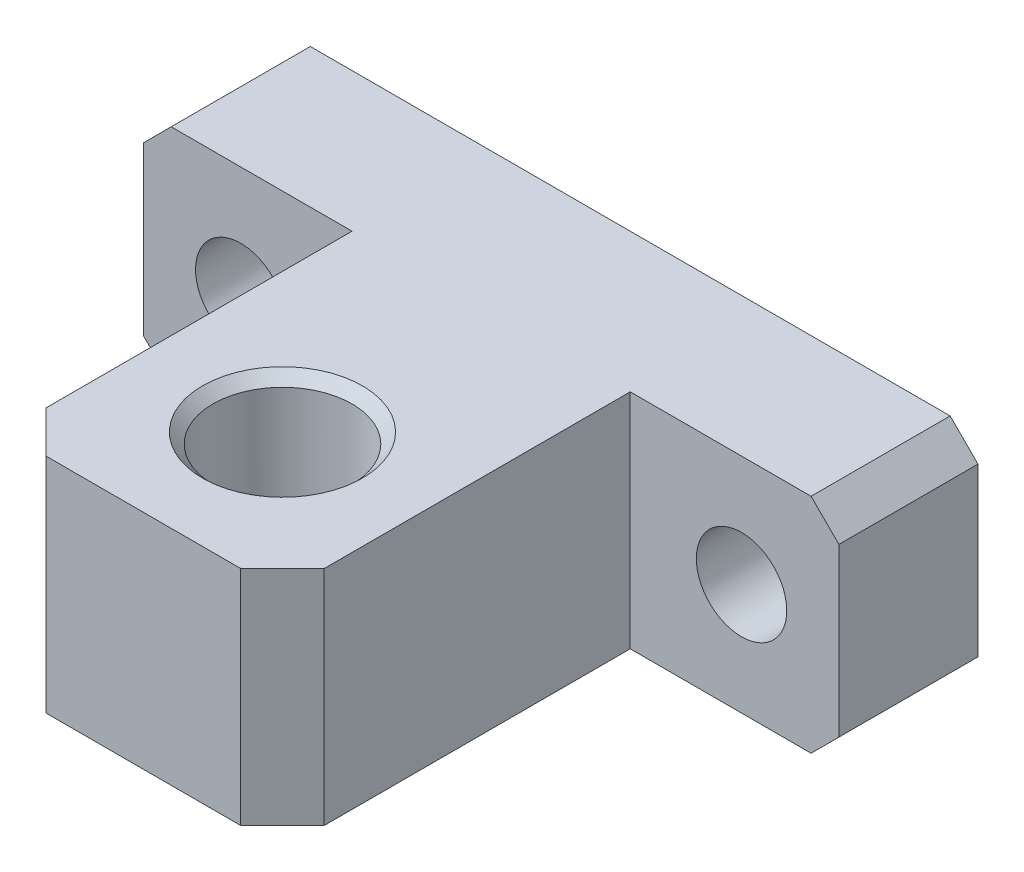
ISO-10303-21;
HEADER;
FILE_DESCRIPTION(('STEP AP214'),'2;1');
FILE_NAME('part.step','',(''),(''),'','','');
FILE_SCHEMA(('AUTOMOTIVE_DESIGN { 1 0 10303 214 1 1 1 1 }'));
ENDSEC;
DATA;
#1=APPLICATION_CONTEXT('core data for automotive mechanical design processes');
#2=APPLICATION_PROTOCOL_DEFINITION('international standard','automotive_design',2000,#1);
#3=PRODUCT_CONTEXT('',#1,'mechanical');
#4=PRODUCT('Part','Part','',(#3));
#5=PRODUCT_RELATED_PRODUCT_CATEGORY('part','',(#4));
#6=PRODUCT_DEFINITION_FORMATION('','',#4);
#7=PRODUCT_DEFINITION_CONTEXT('part definition',#1,'design');
#8=PRODUCT_DEFINITION('design','',#6,#7);
#9=PRODUCT_DEFINITION_SHAPE('','',#8);
#10=(LENGTH_UNIT() NAMED_UNIT(*) SI_UNIT(.MILLI.,.METRE.));
#11=(NAMED_UNIT(*) PLANE_ANGLE_UNIT() SI_UNIT($,.RADIAN.));
#12=(NAMED_UNIT(*) SI_UNIT($,.STERADIAN.) SOLID_ANGLE_UNIT());
#13=UNCERTAINTY_MEASURE_WITH_UNIT(LENGTH_MEASURE(1.E-05),#10,'distance_accuracy_value','');
#14=(GEOMETRIC_REPRESENTATION_CONTEXT(3) GLOBAL_UNCERTAINTY_ASSIGNED_CONTEXT((#13)) GLOBAL_UNIT_ASSIGNED_CONTEXT((#10,
#11,#12)) REPRESENTATION_CONTEXT('',''));
#15=CARTESIAN_POINT('',(0.,0.,0.));
#16=DIRECTION('',(0.,0.,1.));
#17=DIRECTION('',(1.,0.,0.));
#18=AXIS2_PLACEMENT_3D('',#15,#16,#17);
#19=CARTESIAN_POINT('',(-7.,8.,10.));
#20=DIRECTION('',(-1.,0.,0.));
#21=DIRECTION('',(0.,0.,-1.));
#22=AXIS2_PLACEMENT_3D('',#19,#20,#21);
#23=PLANE('',#22);
#24=DIRECTION('',(0.,-1.,0.));
#25=VECTOR('',#24,1.);
#26=CARTESIAN_POINT('',(-7.,8.,0.));
#27=LINE('',#26,#25);
#28=CARTESIAN_POINT('',(-7.,6.,0.));
#29=VERTEX_POINT('',#28);
#30=CARTESIAN_POINT('',(-7.,-6.,0.));
#31=VERTEX_POINT('',#30);
#32=EDGE_CURVE('E152',#29,#31,#27,.T.);
#33=ORIENTED_EDGE('',*,*,#32,.T.);
#34=DIRECTION('',(0.,0.,1.));
#35=VECTOR('',#34,1.);
#36=CARTESIAN_POINT('',(-7.,-6.,10.));
#37=LINE('',#36,#35);
#38=CARTESIAN_POINT('',(-7.,-6.,10.));
#39=VERTEX_POINT('',#38);
#40=EDGE_CURVE('E209',#31,#39,#37,.T.);
#41=ORIENTED_EDGE('',*,*,#40,.T.);
#42=DIRECTION('',(0.,-1.,0.));
#43=VECTOR('',#42,1.);
#44=CARTESIAN_POINT('',(-7.,8.,10.));
#45=LINE('',#44,#43);
#46=CARTESIAN_POINT('',(-7.,6.,10.));
#47=VERTEX_POINT('',#46);
#48=EDGE_CURVE('E168',#47,#39,#45,.T.);
#49=ORIENTED_EDGE('',*,*,#48,.F.);
#50=DIRECTION('',(0.,0.,-1.));
#51=VECTOR('',#50,1.);
#52=CARTESIAN_POINT('',(-7.,6.,10.));
#53=LINE('',#52,#51);
#54=EDGE_CURVE('E206',#47,#29,#53,.T.);
#55=ORIENTED_EDGE('',*,*,#54,.T.);
#56=EDGE_LOOP('',(#33,#41,#49,#55));
#57=FACE_BOUND('',#56,.T.);
#58=ADVANCED_FACE('F14',(#57),#23,.T.);
#59=CARTESIAN_POINT('',(8.,8.,10.));
#60=DIRECTION('',(0.,0.,1.));
#61=DIRECTION('',(-1.,0.,0.));
#62=AXIS2_PLACEMENT_3D('',#59,#60,#61);
#63=PLANE('',#62);
#64=CARTESIAN_POINT('',(0.,0.,10.));
#65=DIRECTION('',(0.,0.,1.));
#66=DIRECTION('',(0.,-1.,0.));
#67=AXIS2_PLACEMENT_3D('',#64,#65,#66);
#68=CIRCLE('',#67,3.25);
#69=CARTESIAN_POINT('',(0.,-3.25,10.));
#70=VERTEX_POINT('',#69);
#71=EDGE_CURVE('E317',#70,#70,#68,.T.);
#72=ORIENTED_EDGE('',*,*,#71,.F.);
#73=EDGE_LOOP('',(#72));
#74=FACE_BOUND('',#73,.T.);
#75=ORIENTED_EDGE('',*,*,#48,.T.);
#76=DIRECTION('',(0.707106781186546,-0.707106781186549,0.));
#77=VECTOR('',#76,1.);
#78=CARTESIAN_POINT('',(-6.5,-6.5,10.));
#79=LINE('',#78,#77);
#80=CARTESIAN_POINT('',(-5.,-8.,10.));
#81=VERTEX_POINT('',#80);
#82=EDGE_CURVE('E213',#39,#81,#79,.T.);
#83=ORIENTED_EDGE('',*,*,#82,.T.);
#84=DIRECTION('',(-1.,0.,0.));
#85=VECTOR('',#84,1.);
#86=CARTESIAN_POINT('',(8.,-8.,10.));
#87=LINE('',#86,#85);
#88=CARTESIAN_POINT('',(8.,-8.,10.));
#89=VERTEX_POINT('',#88);
#90=EDGE_CURVE('E165',#89,#81,#87,.T.);
#91=ORIENTED_EDGE('',*,*,#90,.F.);
#92=DIRECTION('',(0.,-1.,0.));
#93=VECTOR('',#92,1.);
#94=CARTESIAN_POINT('',(8.,8.,10.));
#95=LINE('',#94,#93);
#96=CARTESIAN_POINT('',(8.,8.,10.));
#97=VERTEX_POINT('',#96);
#98=EDGE_CURVE('E137',#97,#89,#95,.T.);
#99=ORIENTED_EDGE('',*,*,#98,.F.);
#100=DIRECTION('',(-1.,0.,0.));
#101=VECTOR('',#100,1.);
#102=CARTESIAN_POINT('',(8.,8.,10.));
#103=LINE('',#102,#101);
#104=CARTESIAN_POINT('',(-5.,8.,10.));
#105=VERTEX_POINT('',#104);
#106=EDGE_CURVE('E149',#97,#105,#103,.T.);
#107=ORIENTED_EDGE('',*,*,#106,.T.);
#108=DIRECTION('',(0.707106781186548,0.707106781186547,0.));
#109=VECTOR('',#108,1.);
#110=CARTESIAN_POINT('',(1.5,14.5,10.));
#111=LINE('',#110,#109);
#112=EDGE_CURVE('E211',#105,#47,#111,.F.);
#113=ORIENTED_EDGE('',*,*,#112,.T.);
#114=EDGE_LOOP('',(#75,#83,#91,#99,#107,#113));
#115=FACE_BOUND('',#114,.T.);
#116=ADVANCED_FACE('F250',(#74,#115),#63,.T.);
#117=CARTESIAN_POINT('',(8.,8.,35.));
#118=DIRECTION('',(-1.,0.,0.));
#119=DIRECTION('',(0.,0.,-1.));
#120=AXIS2_PLACEMENT_3D('',#117,#118,#119);
#121=PLANE('',#120);
#122=DIRECTION('',(0.,0.,-1.));
#123=VECTOR('',#122,1.);
#124=CARTESIAN_POINT('',(8.,-8.,35.));
#125=LINE('',#124,#123);
#126=CARTESIAN_POINT('',(8.,-8.,32.));
#127=VERTEX_POINT('',#126);
#128=EDGE_CURVE('E163',#127,#89,#125,.T.);
#129=ORIENTED_EDGE('',*,*,#128,.F.);
#130=DIRECTION('',(0.,1.,0.));
#131=VECTOR('',#130,1.);
#132=CARTESIAN_POINT('',(8.,8.,32.));
#133=LINE('',#132,#131);
#134=CARTESIAN_POINT('',(8.,8.,32.));
#135=VERTEX_POINT('',#134);
#136=EDGE_CURVE('E38',#127,#135,#133,.T.);
#137=ORIENTED_EDGE('',*,*,#136,.T.);
#138=DIRECTION('',(0.,0.,-1.));
#139=VECTOR('',#138,1.);
#140=CARTESIAN_POINT('',(8.,8.,35.));
#141=LINE('',#140,#139);
#142=EDGE_CURVE('E144',#135,#97,#141,.T.);
#143=ORIENTED_EDGE('',*,*,#142,.T.);
#144=ORIENTED_EDGE('',*,*,#98,.T.);
#145=EDGE_LOOP('',(#129,#137,#143,#144));
#146=FACE_BOUND('',#145,.T.);
#147=ADVANCED_FACE('F256',(#146),#121,.T.);
#148=CARTESIAN_POINT('',(28.,8.,35.));
#149=DIRECTION('',(0.,0.,1.));
#150=DIRECTION('',(0.,-1.,0.));
#151=AXIS2_PLACEMENT_3D('',#148,#149,#150);
#152=PLANE('',#151);
#153=DIRECTION('',(-1.,0.,0.));
#154=VECTOR('',#153,1.);
#155=CARTESIAN_POINT('',(28.,8.,35.));
#156=LINE('',#155,#154);
#157=CARTESIAN_POINT('',(25.,8.,35.));
#158=VERTEX_POINT('',#157);
#159=CARTESIAN_POINT('',(11.,8.,35.));
#160=VERTEX_POINT('',#159);
#161=EDGE_CURVE('E141',#158,#160,#156,.T.);
#162=ORIENTED_EDGE('',*,*,#161,.T.);
#163=DIRECTION('',(0.,-1.,0.));
#164=VECTOR('',#163,1.);
#165=CARTESIAN_POINT('',(11.,8.,35.));
#166=LINE('',#165,#164);
#167=CARTESIAN_POINT('',(11.,-8.,35.));
#168=VERTEX_POINT('',#167);
#169=EDGE_CURVE('E217',#160,#168,#166,.T.);
#170=ORIENTED_EDGE('',*,*,#169,.T.);
#171=DIRECTION('',(-1.,0.,0.));
#172=VECTOR('',#171,1.);
#173=CARTESIAN_POINT('',(28.,-8.,35.));
#174=LINE('',#173,#172);
#175=CARTESIAN_POINT('',(25.,-8.,35.));
#176=VERTEX_POINT('',#175);
#177=EDGE_CURVE('E160',#176,#168,#174,.T.);
#178=ORIENTED_EDGE('',*,*,#177,.F.);
#179=DIRECTION('',(0.,1.,0.));
#180=VECTOR('',#179,1.);
#181=CARTESIAN_POINT('',(25.,8.,35.));
#182=LINE('',#181,#180);
#183=EDGE_CURVE('E215',#176,#158,#182,.T.);
#184=ORIENTED_EDGE('',*,*,#183,.T.);
#185=EDGE_LOOP('',(#162,#170,#178,#184));
#186=FACE_BOUND('',#185,.T.);
#187=ADVANCED_FACE('F288',(#186),#152,.T.);
#188=CARTESIAN_POINT('',(28.,8.,10.));
#189=DIRECTION('',(1.,0.,0.));
#190=DIRECTION('',(0.,0.,1.));
#191=AXIS2_PLACEMENT_3D('',#188,#189,#190);
#192=PLANE('',#191);
#193=DIRECTION('',(0.,0.,1.));
#194=VECTOR('',#193,1.);
#195=CARTESIAN_POINT('',(28.,8.,10.));
#196=LINE('',#195,#194);
#197=CARTESIAN_POINT('',(28.,8.,10.));
#198=VERTEX_POINT('',#197);
#199=CARTESIAN_POINT('',(28.,8.,32.));
#200=VERTEX_POINT('',#199);
#201=EDGE_CURVE('E128',#198,#200,#196,.T.);
#202=ORIENTED_EDGE('',*,*,#201,.T.);
#203=DIRECTION('',(0.,-1.,0.));
#204=VECTOR('',#203,1.);
#205=CARTESIAN_POINT('',(28.,8.,32.));
#206=LINE('',#205,#204);
#207=CARTESIAN_POINT('',(28.,-8.,32.));
#208=VERTEX_POINT('',#207);
#209=EDGE_CURVE('E228',#200,#208,#206,.T.);
#210=ORIENTED_EDGE('',*,*,#209,.T.);
#211=DIRECTION('',(0.,0.,1.));
#212=VECTOR('',#211,1.);
#213=CARTESIAN_POINT('',(28.,-8.,10.));
#214=LINE('',#213,#212);
#215=CARTESIAN_POINT('',(28.,-8.,10.));
#216=VERTEX_POINT('',#215);
#217=EDGE_CURVE('E136',#216,#208,#214,.T.);
#218=ORIENTED_EDGE('',*,*,#217,.F.);
#219=DIRECTION('',(0.,-1.,0.));
#220=VECTOR('',#219,1.);
#221=CARTESIAN_POINT('',(28.,8.,10.));
#222=LINE('',#221,#220);
#223=EDGE_CURVE('E123',#198,#216,#222,.T.);
#224=ORIENTED_EDGE('',*,*,#223,.F.);
#225=EDGE_LOOP('',(#202,#210,#218,#224));
#226=FACE_BOUND('',#225,.T.);
#227=ADVANCED_FACE('F132',(#226),#192,.T.);
#228=CARTESIAN_POINT('',(43.,8.,10.));
#229=DIRECTION('',(0.,0.,1.));
#230=DIRECTION('',(-1.,0.,0.));
#231=AXIS2_PLACEMENT_3D('',#228,#229,#230);
#232=PLANE('',#231);
#233=CARTESIAN_POINT('',(36.,0.,10.));
#234=DIRECTION('',(0.,0.,1.));
#235=DIRECTION('',(0.,-1.,0.));
#236=AXIS2_PLACEMENT_3D('',#233,#234,#235);
#237=CIRCLE('',#236,3.25);
#238=CARTESIAN_POINT('',(36.,-3.24999999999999,10.));
#239=VERTEX_POINT('',#238);
#240=EDGE_CURVE('E323',#239,#239,#237,.T.);
#241=ORIENTED_EDGE('',*,*,#240,.F.);
#242=EDGE_LOOP('',(#241));
#243=FACE_BOUND('',#242,.T.);
#244=DIRECTION('',(-1.,0.,0.));
#245=VECTOR('',#244,1.);
#246=CARTESIAN_POINT('',(43.,-8.,10.));
#247=LINE('',#246,#245);
#248=CARTESIAN_POINT('',(41.,-8.,10.));
#249=VERTEX_POINT('',#248);
#250=EDGE_CURVE('E156',#249,#216,#247,.T.);
#251=ORIENTED_EDGE('',*,*,#250,.F.);
#252=DIRECTION('',(0.707106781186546,0.707106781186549,0.));
#253=VECTOR('',#252,1.);
#254=CARTESIAN_POINT('',(50.,1.00000000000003,10.));
#255=LINE('',#254,#253);
#256=CARTESIAN_POINT('',(43.,-6.,10.));
#257=VERTEX_POINT('',#256);
#258=EDGE_CURVE('E187',#249,#257,#255,.T.);
#259=ORIENTED_EDGE('',*,*,#258,.T.);
#260=DIRECTION('',(0.,-1.,0.));
#261=VECTOR('',#260,1.);
#262=CARTESIAN_POINT('',(43.,8.,10.));
#263=LINE('',#262,#261);
#264=CARTESIAN_POINT('',(43.,6.,10.));
#265=VERTEX_POINT('',#264);
#266=EDGE_CURVE('E138',#265,#257,#263,.T.);
#267=ORIENTED_EDGE('',*,*,#266,.F.);
#268=DIRECTION('',(0.707106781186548,-0.707106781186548,0.));
#269=VECTOR('',#268,1.);
#270=CARTESIAN_POINT('',(42.,7.,10.));
#271=LINE('',#270,#269);
#272=CARTESIAN_POINT('',(41.,8.,10.));
#273=VERTEX_POINT('',#272);
#274=EDGE_CURVE('E126',#265,#273,#271,.F.);
#275=ORIENTED_EDGE('',*,*,#274,.T.);
#276=DIRECTION('',(-1.,0.,0.));
#277=VECTOR('',#276,1.);
#278=CARTESIAN_POINT('',(43.,8.,10.));
#279=LINE('',#278,#277);
#280=EDGE_CURVE('E119',#273,#198,#279,.T.);
#281=ORIENTED_EDGE('',*,*,#280,.T.);
#282=ORIENTED_EDGE('',*,*,#223,.T.);
#283=EDGE_LOOP('',(#251,#259,#267,#275,#281,#282));
#284=FACE_BOUND('',#283,.T.);
#285=ADVANCED_FACE('F122',(#243,#284),#232,.T.);
#286=CARTESIAN_POINT('',(43.,8.,0.));
#287=DIRECTION('',(1.,0.,0.));
#288=DIRECTION('',(0.,0.,1.));
#289=AXIS2_PLACEMENT_3D('',#286,#287,#288);
#290=PLANE('',#289);
#291=ORIENTED_EDGE('',*,*,#266,.T.);
#292=DIRECTION('',(0.,0.,-1.));
#293=VECTOR('',#292,1.);
#294=CARTESIAN_POINT('',(43.,-6.,0.));
#295=LINE('',#294,#293);
#296=CARTESIAN_POINT('',(43.,-6.,0.));
#297=VERTEX_POINT('',#296);
#298=EDGE_CURVE('E192',#257,#297,#295,.T.);
#299=ORIENTED_EDGE('',*,*,#298,.T.);
#300=DIRECTION('',(0.,-1.,0.));
#301=VECTOR('',#300,1.);
#302=CARTESIAN_POINT('',(43.,8.,0.));
#303=LINE('',#302,#301);
#304=CARTESIAN_POINT('',(43.,6.,0.));
#305=VERTEX_POINT('',#304);
#306=EDGE_CURVE('E176',#305,#297,#303,.T.);
#307=ORIENTED_EDGE('',*,*,#306,.F.);
#308=DIRECTION('',(0.,0.,1.));
#309=VECTOR('',#308,1.);
#310=CARTESIAN_POINT('',(43.,6.,0.));
#311=LINE('',#310,#309);
#312=EDGE_CURVE('E189',#305,#265,#311,.T.);
#313=ORIENTED_EDGE('',*,*,#312,.T.);
#314=EDGE_LOOP('',(#291,#299,#307,#313));
#315=FACE_BOUND('',#314,.T.);
#316=ADVANCED_FACE('F296',(#315),#290,.T.);
#317=CARTESIAN_POINT('',(-7.,8.,0.));
#318=DIRECTION('',(0.,0.,-1.));
#319=DIRECTION('',(0.,1.,0.));
#320=AXIS2_PLACEMENT_3D('',#317,#318,#319);
#321=PLANE('',#320);
#322=CARTESIAN_POINT('',(36.,0.,0.));
#323=DIRECTION('',(0.,0.,-1.));
#324=DIRECTION('',(0.,1.,0.));
#325=AXIS2_PLACEMENT_3D('',#322,#323,#324);
#326=CIRCLE('',#325,3.25);
#327=CARTESIAN_POINT('',(36.,3.25,0.));
#328=VERTEX_POINT('',#327);
#329=EDGE_CURVE('E320',#328,#328,#326,.T.);
#330=ORIENTED_EDGE('',*,*,#329,.F.);
#331=EDGE_LOOP('',(#330));
#332=FACE_BOUND('',#331,.T.);
#333=CARTESIAN_POINT('',(0.,0.,0.));
#334=DIRECTION('',(0.,0.,-1.));
#335=DIRECTION('',(0.,1.,0.));
#336=AXIS2_PLACEMENT_3D('',#333,#334,#335);
#337=CIRCLE('',#336,3.25);
#338=CARTESIAN_POINT('',(0.,3.25,0.));
#339=VERTEX_POINT('',#338);
#340=EDGE_CURVE('E157',#339,#339,#337,.T.);
#341=ORIENTED_EDGE('',*,*,#340,.F.);
#342=EDGE_LOOP('',(#341));
#343=FACE_BOUND('',#342,.T.);
#344=ORIENTED_EDGE('',*,*,#306,.T.);
#345=DIRECTION('',(-0.707106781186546,-0.707106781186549,0.));
#346=VECTOR('',#345,1.);
#347=CARTESIAN_POINT('',(25.,-24.,0.));
#348=LINE('',#347,#346);
#349=CARTESIAN_POINT('',(41.,-8.,0.));
#350=VERTEX_POINT('',#349);
#351=EDGE_CURVE('E200',#297,#350,#348,.T.);
#352=ORIENTED_EDGE('',*,*,#351,.T.);
#353=DIRECTION('',(1.,0.,0.));
#354=VECTOR('',#353,1.);
#355=CARTESIAN_POINT('',(-7.,-8.,0.));
#356=LINE('',#355,#354);
#357=CARTESIAN_POINT('',(-5.,-8.,0.));
#358=VERTEX_POINT('',#357);
#359=EDGE_CURVE('E153',#358,#350,#356,.T.);
#360=ORIENTED_EDGE('',*,*,#359,.F.);
#361=DIRECTION('',(-0.707106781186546,0.707106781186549,0.));
#362=VECTOR('',#361,1.);
#363=CARTESIAN_POINT('',(-14.,1.00000000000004,0.));
#364=LINE('',#363,#362);
#365=EDGE_CURVE('E196',#358,#31,#364,.T.);
#366=ORIENTED_EDGE('',*,*,#365,.T.);
#367=ORIENTED_EDGE('',*,*,#32,.F.);
#368=DIRECTION('',(-0.707106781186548,-0.707106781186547,0.));
#369=VECTOR('',#368,1.);
#370=CARTESIAN_POINT('',(-6.,7.,0.));
#371=LINE('',#370,#369);
#372=CARTESIAN_POINT('',(-5.,8.,0.));
#373=VERTEX_POINT('',#372);
#374=EDGE_CURVE('E194',#29,#373,#371,.F.);
#375=ORIENTED_EDGE('',*,*,#374,.T.);
#376=DIRECTION('',(1.,0.,0.));
#377=VECTOR('',#376,1.);
#378=CARTESIAN_POINT('',(-7.,8.,0.));
#379=LINE('',#378,#377);
#380=CARTESIAN_POINT('',(41.,8.,0.));
#381=VERTEX_POINT('',#380);
#382=EDGE_CURVE('E129',#373,#381,#379,.T.);
#383=ORIENTED_EDGE('',*,*,#382,.T.);
#384=DIRECTION('',(-0.707106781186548,0.707106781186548,0.));
#385=VECTOR('',#384,1.);
#386=CARTESIAN_POINT('',(17.,32.,0.));
#387=LINE('',#386,#385);
#388=EDGE_CURVE('E198',#381,#305,#387,.F.);
#389=ORIENTED_EDGE('',*,*,#388,.T.);
#390=EDGE_LOOP('',(#344,#352,#360,#366,#367,#375,#383,#389));
#391=FACE_BOUND('',#390,.T.);
#392=ADVANCED_FACE('F261',(#332,#343,#391),#321,.T.);
#393=CARTESIAN_POINT('',(-7.,8.,10.));
#394=DIRECTION('',(0.,1.,0.));
#395=DIRECTION('',(-1.,0.,0.));
#396=AXIS2_PLACEMENT_3D('',#393,#394,#395);
#397=PLANE('',#396);
#398=CARTESIAN_POINT('',(18.,8.,25.));
#399=DIRECTION('',(0.,1.,0.));
#400=DIRECTION('',(-1.,0.,0.));
#401=AXIS2_PLACEMENT_3D('',#398,#399,#400);
#402=CIRCLE('',#401,5.75);
#403=CARTESIAN_POINT('',(12.25,8.,25.));
#404=VERTEX_POINT('',#403);
#405=EDGE_CURVE('E23',#404,#404,#402,.F.);
#406=ORIENTED_EDGE('',*,*,#405,.T.);
#407=EDGE_LOOP('',(#406));
#408=FACE_BOUND('',#407,.T.);
#409=ORIENTED_EDGE('',*,*,#142,.F.);
#410=DIRECTION('',(-0.707106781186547,0.,-0.707106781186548));
#411=VECTOR('',#410,1.);
#412=CARTESIAN_POINT('',(-10.5,8.,13.5));
#413=LINE('',#412,#411);
#414=EDGE_CURVE('E226',#135,#160,#413,.F.);
#415=ORIENTED_EDGE('',*,*,#414,.T.);
#416=ORIENTED_EDGE('',*,*,#161,.F.);
#417=DIRECTION('',(-0.707106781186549,0.,0.707106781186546));
#418=VECTOR('',#417,1.);
#419=CARTESIAN_POINT('',(21.5,8.,38.5));
#420=LINE('',#419,#418);
#421=EDGE_CURVE('E30',#158,#200,#420,.F.);
#422=ORIENTED_EDGE('',*,*,#421,.T.);
#423=ORIENTED_EDGE('',*,*,#201,.F.);
#424=ORIENTED_EDGE('',*,*,#280,.F.);
#425=DIRECTION('',(0.,0.,-1.));
#426=VECTOR('',#425,1.);
#427=CARTESIAN_POINT('',(41.,8.,10.));
#428=LINE('',#427,#426);
#429=EDGE_CURVE('E204',#273,#381,#428,.T.);
#430=ORIENTED_EDGE('',*,*,#429,.T.);
#431=ORIENTED_EDGE('',*,*,#382,.F.);
#432=DIRECTION('',(0.,0.,1.));
#433=VECTOR('',#432,1.);
#434=CARTESIAN_POINT('',(-5.,8.,10.));
#435=LINE('',#434,#433);
#436=EDGE_CURVE('E202',#373,#105,#435,.T.);
#437=ORIENTED_EDGE('',*,*,#436,.T.);
#438=ORIENTED_EDGE('',*,*,#106,.F.);
#439=EDGE_LOOP('',(#409,#415,#416,#422,#423,#424,#430,#431,#437,#438));
#440=FACE_BOUND('',#439,.T.);
#441=ADVANCED_FACE('F140',(#408,#440),#397,.T.);
#442=CARTESIAN_POINT('',(-7.,-8.,10.));
#443=DIRECTION('',(0.,1.,0.));
#444=DIRECTION('',(-1.,0.,0.));
#445=AXIS2_PLACEMENT_3D('',#442,#443,#444);
#446=PLANE('',#445);
#447=CARTESIAN_POINT('',(18.,-8.,25.));
#448=DIRECTION('',(0.,1.,0.));
#449=DIRECTION('',(-1.,0.,0.));
#450=AXIS2_PLACEMENT_3D('',#447,#448,#449);
#451=CIRCLE('',#450,5.75);
#452=CARTESIAN_POINT('',(12.25,-8.,25.));
#453=VERTEX_POINT('',#452);
#454=EDGE_CURVE('E9',#453,#453,#451,.T.);
#455=ORIENTED_EDGE('',*,*,#454,.T.);
#456=EDGE_LOOP('',(#455));
#457=FACE_BOUND('',#456,.T.);
#458=ORIENTED_EDGE('',*,*,#177,.T.);
#459=DIRECTION('',(0.707106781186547,0.,0.707106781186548));
#460=VECTOR('',#459,1.);
#461=CARTESIAN_POINT('',(11.,-8.,35.));
#462=LINE('',#461,#460);
#463=EDGE_CURVE('E222',#168,#127,#462,.F.);
#464=ORIENTED_EDGE('',*,*,#463,.T.);
#465=ORIENTED_EDGE('',*,*,#128,.T.);
#466=ORIENTED_EDGE('',*,*,#90,.T.);
#467=DIRECTION('',(0.,0.,-1.));
#468=VECTOR('',#467,1.);
#469=CARTESIAN_POINT('',(-5.,-8.,0.));
#470=LINE('',#469,#468);
#471=EDGE_CURVE('E171',#81,#358,#470,.T.);
#472=ORIENTED_EDGE('',*,*,#471,.T.);
#473=ORIENTED_EDGE('',*,*,#359,.T.);
#474=DIRECTION('',(0.,0.,1.));
#475=VECTOR('',#474,1.);
#476=CARTESIAN_POINT('',(41.,-8.,10.));
#477=LINE('',#476,#475);
#478=EDGE_CURVE('E183',#350,#249,#477,.T.);
#479=ORIENTED_EDGE('',*,*,#478,.T.);
#480=ORIENTED_EDGE('',*,*,#250,.T.);
#481=ORIENTED_EDGE('',*,*,#217,.T.);
#482=DIRECTION('',(0.707106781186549,0.,-0.707106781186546));
#483=VECTOR('',#482,1.);
#484=CARTESIAN_POINT('',(28.,-8.,32.));
#485=LINE('',#484,#483);
#486=EDGE_CURVE('E220',#208,#176,#485,.F.);
#487=ORIENTED_EDGE('',*,*,#486,.T.);
#488=EDGE_LOOP('',(#458,#464,#465,#466,#472,#473,#479,#480,#481,#487));
#489=FACE_BOUND('',#488,.T.);
#490=ADVANCED_FACE('F292',(#457,#489),#446,.F.);
#491=CARTESIAN_POINT('',(0.,0.,10.));
#492=DIRECTION('',(0.,0.,1.));
#493=DIRECTION('',(0.,-1.,0.));
#494=AXIS2_PLACEMENT_3D('',#491,#492,#493);
#495=CYLINDRICAL_SURFACE('',#494,3.25);
#496=ORIENTED_EDGE('',*,*,#71,.T.);
#497=EDGE_LOOP('',(#496));
#498=FACE_BOUND('',#497,.T.);
#499=ORIENTED_EDGE('',*,*,#340,.T.);
#500=EDGE_LOOP('',(#499));
#501=FACE_BOUND('',#500,.T.);
#502=ADVANCED_FACE('F336',(#498,#501),#495,.F.);
#503=CARTESIAN_POINT('',(36.,0.,10.));
#504=DIRECTION('',(0.,0.,1.));
#505=DIRECTION('',(0.,-1.,0.));
#506=AXIS2_PLACEMENT_3D('',#503,#504,#505);
#507=CYLINDRICAL_SURFACE('',#506,3.25);
#508=ORIENTED_EDGE('',*,*,#240,.T.);
#509=EDGE_LOOP('',(#508));
#510=FACE_BOUND('',#509,.T.);
#511=ORIENTED_EDGE('',*,*,#329,.T.);
#512=EDGE_LOOP('',(#511));
#513=FACE_BOUND('',#512,.T.);
#514=ADVANCED_FACE('F267',(#510,#513),#507,.F.);
#515=CARTESIAN_POINT('',(41.,-8.,10.));
#516=DIRECTION('',(0.707106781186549,-0.707106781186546,0.));
#517=DIRECTION('',(0.707106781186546,0.707106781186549,0.));
#518=AXIS2_PLACEMENT_3D('',#515,#516,#517);
#519=PLANE('',#518);
#520=ORIENTED_EDGE('',*,*,#351,.F.);
#521=ORIENTED_EDGE('',*,*,#298,.F.);
#522=ORIENTED_EDGE('',*,*,#258,.F.);
#523=ORIENTED_EDGE('',*,*,#478,.F.);
#524=EDGE_LOOP('',(#520,#521,#522,#523));
#525=FACE_BOUND('',#524,.T.);
#526=ADVANCED_FACE('F263',(#525),#519,.T.);
#527=CARTESIAN_POINT('',(43.,6.,0.));
#528=DIRECTION('',(-0.707106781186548,-0.707106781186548,0.));
#529=DIRECTION('',(0.707106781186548,-0.707106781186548,0.));
#530=AXIS2_PLACEMENT_3D('',#527,#528,#529);
#531=PLANE('',#530);
#532=ORIENTED_EDGE('',*,*,#388,.F.);
#533=ORIENTED_EDGE('',*,*,#429,.F.);
#534=ORIENTED_EDGE('',*,*,#274,.F.);
#535=ORIENTED_EDGE('',*,*,#312,.F.);
#536=EDGE_LOOP('',(#532,#533,#534,#535));
#537=FACE_BOUND('',#536,.T.);
#538=ADVANCED_FACE('F266',(#537),#531,.F.);
#539=CARTESIAN_POINT('',(-5.,-8.,10.));
#540=DIRECTION('',(-0.707106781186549,-0.707106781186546,0.));
#541=DIRECTION('',(0.707106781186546,-0.707106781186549,0.));
#542=AXIS2_PLACEMENT_3D('',#539,#540,#541);
#543=PLANE('',#542);
#544=ORIENTED_EDGE('',*,*,#82,.F.);
#545=ORIENTED_EDGE('',*,*,#40,.F.);
#546=ORIENTED_EDGE('',*,*,#365,.F.);
#547=ORIENTED_EDGE('',*,*,#471,.F.);
#548=EDGE_LOOP('',(#544,#545,#546,#547));
#549=FACE_BOUND('',#548,.T.);
#550=ADVANCED_FACE('F271',(#549),#543,.T.);
#551=CARTESIAN_POINT('',(-7.,6.,10.));
#552=DIRECTION('',(0.707106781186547,-0.707106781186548,0.));
#553=DIRECTION('',(0.707106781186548,0.707106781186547,0.));
#554=AXIS2_PLACEMENT_3D('',#551,#552,#553);
#555=PLANE('',#554);
#556=ORIENTED_EDGE('',*,*,#112,.F.);
#557=ORIENTED_EDGE('',*,*,#436,.F.);
#558=ORIENTED_EDGE('',*,*,#374,.F.);
#559=ORIENTED_EDGE('',*,*,#54,.F.);
#560=EDGE_LOOP('',(#556,#557,#558,#559));
#561=FACE_BOUND('',#560,.T.);
#562=ADVANCED_FACE('F275',(#561),#555,.F.);
#563=CARTESIAN_POINT('',(11.,8.,35.));
#564=DIRECTION('',(0.707106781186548,0.,-0.707106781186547));
#565=DIRECTION('',(0.707106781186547,0.,0.707106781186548));
#566=AXIS2_PLACEMENT_3D('',#563,#564,#565);
#567=PLANE('',#566);
#568=ORIENTED_EDGE('',*,*,#414,.F.);
#569=ORIENTED_EDGE('',*,*,#136,.F.);
#570=ORIENTED_EDGE('',*,*,#463,.F.);
#571=ORIENTED_EDGE('',*,*,#169,.F.);
#572=EDGE_LOOP('',(#568,#569,#570,#571));
#573=FACE_BOUND('',#572,.T.);
#574=ADVANCED_FACE('F245',(#573),#567,.F.);
#575=CARTESIAN_POINT('',(28.,8.,32.));
#576=DIRECTION('',(-0.707106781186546,0.,-0.707106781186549));
#577=DIRECTION('',(0.707106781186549,0.,-0.707106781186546));
#578=AXIS2_PLACEMENT_3D('',#575,#576,#577);
#579=PLANE('',#578);
#580=ORIENTED_EDGE('',*,*,#421,.F.);
#581=ORIENTED_EDGE('',*,*,#183,.F.);
#582=ORIENTED_EDGE('',*,*,#486,.F.);
#583=ORIENTED_EDGE('',*,*,#209,.F.);
#584=EDGE_LOOP('',(#580,#581,#582,#583));
#585=FACE_BOUND('',#584,.T.);
#586=ADVANCED_FACE('F236',(#585),#579,.F.);
#587=CARTESIAN_POINT('',(18.,6.5,25.));
#588=DIRECTION('',(0.,1.,0.));
#589=DIRECTION('',(-1.,0.,0.));
#590=AXIS2_PLACEMENT_3D('',#587,#588,#589);
#591=CONICAL_SURFACE('',#590,4.25,0.785398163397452);
#592=CARTESIAN_POINT('',(18.,7.25,25.));
#593=DIRECTION('',(0.,1.,0.));
#594=DIRECTION('',(0.,0.,1.));
#595=AXIS2_PLACEMENT_3D('',#592,#593,#594);
#596=CIRCLE('',#595,5.);
#597=CARTESIAN_POINT('',(18.,7.25,30.));
#598=VERTEX_POINT('',#597);
#599=EDGE_CURVE('E326',#598,#598,#596,.T.);
#600=ORIENTED_EDGE('',*,*,#599,.F.);
#601=EDGE_LOOP('',(#600));
#602=FACE_BOUND('',#601,.T.);
#603=ORIENTED_EDGE('',*,*,#405,.F.);
#604=EDGE_LOOP('',(#603));
#605=FACE_BOUND('',#604,.T.);
#606=ADVANCED_FACE('F234',(#602,#605),#591,.F.);
#607=CARTESIAN_POINT('',(18.,-8.,25.));
#608=DIRECTION('',(0.,-1.,0.));
#609=DIRECTION('',(1.,0.,0.));
#610=AXIS2_PLACEMENT_3D('',#607,#608,#609);
#611=CONICAL_SURFACE('',#610,5.75,0.785398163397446);
#612=CARTESIAN_POINT('',(18.,-7.25,25.));
#613=DIRECTION('',(0.,-1.,0.));
#614=DIRECTION('',(0.,0.,-1.));
#615=AXIS2_PLACEMENT_3D('',#612,#613,#614);
#616=CIRCLE('',#615,5.);
#617=CARTESIAN_POINT('',(18.,-7.25,20.));
#618=VERTEX_POINT('',#617);
#619=EDGE_CURVE('E18',#618,#618,#616,.T.);
#620=ORIENTED_EDGE('',*,*,#619,.F.);
#621=EDGE_LOOP('',(#620));
#622=FACE_BOUND('',#621,.T.);
#623=ORIENTED_EDGE('',*,*,#454,.F.);
#624=EDGE_LOOP('',(#623));
#625=FACE_BOUND('',#624,.T.);
#626=ADVANCED_FACE('F16',(#622,#625),#611,.F.);
#627=CARTESIAN_POINT('',(18.,-8.,25.));
#628=DIRECTION('',(0.,1.,0.));
#629=DIRECTION('',(0.,0.,1.));
#630=AXIS2_PLACEMENT_3D('',#627,#628,#629);
#631=CYLINDRICAL_SURFACE('',#630,5.);
#632=ORIENTED_EDGE('',*,*,#599,.T.);
#633=EDGE_LOOP('',(#632));
#634=FACE_BOUND('',#633,.T.);
#635=ORIENTED_EDGE('',*,*,#619,.T.);
#636=EDGE_LOOP('',(#635));
#637=FACE_BOUND('',#636,.T.);
#638=ADVANCED_FACE('F243',(#634,#637),#631,.F.);
#639=CLOSED_SHELL('',(#58,#116,#147,#187,#227,#285,#316,#392,#441,#490,#502,#514,#526,#538,#550,
#562,#574,#586,#606,#626,#638));
#640=MANIFOLD_SOLID_BREP('B1',#639);
#641=ADVANCED_BREP_SHAPE_REPRESENTATION('',(#18,#640),#14);
#642=SHAPE_DEFINITION_REPRESENTATION(#9,#641);
ENDSEC;
END-ISO-10303-21;
